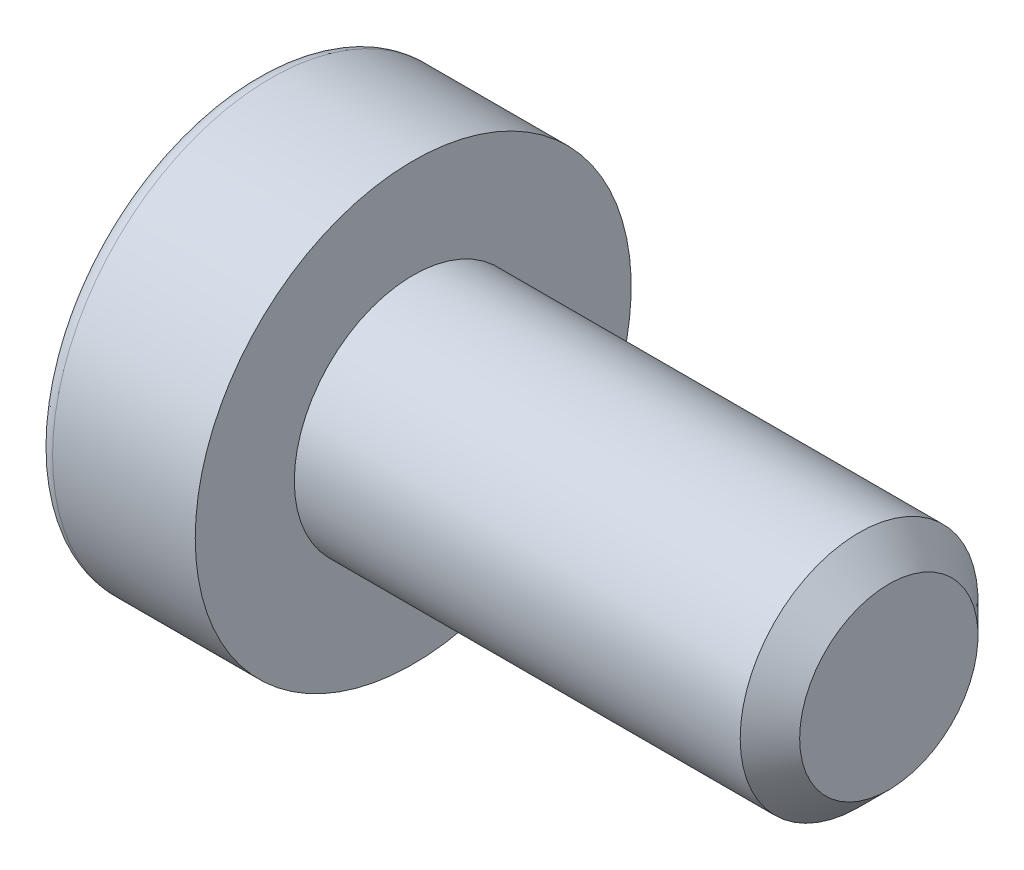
ISO-10303-21;
HEADER;
FILE_DESCRIPTION(('STEP AP214'),'2;1');
FILE_NAME('part.step','',(''),(''),'','','');
FILE_SCHEMA(('AUTOMOTIVE_DESIGN { 1 0 10303 214 1 1 1 1 }'));
ENDSEC;
DATA;
#1=APPLICATION_CONTEXT('core data for automotive mechanical design processes');
#2=APPLICATION_PROTOCOL_DEFINITION('international standard','automotive_design',2000,#1);
#3=PRODUCT_CONTEXT('',#1,'mechanical');
#4=PRODUCT('Part','Part','',(#3));
#5=PRODUCT_RELATED_PRODUCT_CATEGORY('part','',(#4));
#6=PRODUCT_DEFINITION_FORMATION('','',#4);
#7=PRODUCT_DEFINITION_CONTEXT('part definition',#1,'design');
#8=PRODUCT_DEFINITION('design','',#6,#7);
#9=PRODUCT_DEFINITION_SHAPE('','',#8);
#10=(LENGTH_UNIT() NAMED_UNIT(*) SI_UNIT(.MILLI.,.METRE.));
#11=(NAMED_UNIT(*) PLANE_ANGLE_UNIT() SI_UNIT($,.RADIAN.));
#12=(NAMED_UNIT(*) SI_UNIT($,.STERADIAN.) SOLID_ANGLE_UNIT());
#13=UNCERTAINTY_MEASURE_WITH_UNIT(LENGTH_MEASURE(1.E-05),#10,'distance_accuracy_value','');
#14=(GEOMETRIC_REPRESENTATION_CONTEXT(3) GLOBAL_UNCERTAINTY_ASSIGNED_CONTEXT((#13)) GLOBAL_UNIT_ASSIGNED_CONTEXT((#10,
#11,#12)) REPRESENTATION_CONTEXT('',''));
#15=CARTESIAN_POINT('',(0.,0.,0.));
#16=DIRECTION('',(0.,0.,1.));
#17=DIRECTION('',(1.,0.,0.));
#18=AXIS2_PLACEMENT_3D('',#15,#16,#17);
#19=CARTESIAN_POINT('',(0.,2.75000000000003,0.));
#20=DIRECTION('',(0.999999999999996,0.,0.));
#21=DIRECTION('',(0.,0.,-0.999999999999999));
#22=AXIS2_PLACEMENT_3D('',#19,#20,#21);
#23=PLANE('',#22);
#24=CARTESIAN_POINT('',(0.,0.,0.));
#25=DIRECTION('',(0.999999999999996,0.,0.));
#26=DIRECTION('',(0.,0.,-0.999999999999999));
#27=AXIS2_PLACEMENT_3D('',#24,#25,#26);
#28=CIRCLE('',#27,2.55);
#29=CARTESIAN_POINT('',(0.,0.,-2.55));
#30=VERTEX_POINT('',#29);
#31=EDGE_CURVE('E31',#30,#30,#28,.F.);
#32=ORIENTED_EDGE('',*,*,#31,.T.);
#33=EDGE_LOOP('',(#32));
#34=FACE_BOUND('',#33,.T.);
#35=DIRECTION('',(0.,-0.999999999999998,0.));
#36=VECTOR('',#35,1.);
#37=CARTESIAN_POINT('',(0.,0.721687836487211,-1.2499999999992));
#38=LINE('',#37,#36);
#39=CARTESIAN_POINT('',(0.,0.721687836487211,-1.2499999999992));
#40=VERTEX_POINT('',#39);
#41=CARTESIAN_POINT('',(0.,-0.721687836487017,-1.24999999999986));
#42=VERTEX_POINT('',#41);
#43=EDGE_CURVE('E99',#40,#42,#38,.T.);
#44=ORIENTED_EDGE('',*,*,#43,.F.);
#45=DIRECTION('',(0.,-0.499999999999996,-0.866025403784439));
#46=VECTOR('',#45,1.);
#47=CARTESIAN_POINT('',(0.,1.44337567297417,8.88178419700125E-13));
#48=LINE('',#47,#46);
#49=CARTESIAN_POINT('',(0.,1.44337567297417,8.88178419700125E-13));
#50=VERTEX_POINT('',#49);
#51=EDGE_CURVE('E38',#50,#40,#48,.T.);
#52=ORIENTED_EDGE('',*,*,#51,.F.);
#53=DIRECTION('',(0.,0.499999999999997,-0.86602540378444));
#54=VECTOR('',#53,1.);
#55=CARTESIAN_POINT('',(0.,1.44337567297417,8.88178419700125E-13));
#56=LINE('',#55,#54);
#57=CARTESIAN_POINT('',(0.,0.721687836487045,1.25000000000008));
#58=VERTEX_POINT('',#57);
#59=EDGE_CURVE('E129',#58,#50,#56,.T.);
#60=ORIENTED_EDGE('',*,*,#59,.F.);
#61=DIRECTION('',(0.,0.999999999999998,0.));
#62=VECTOR('',#61,1.);
#63=CARTESIAN_POINT('',(0.,0.721687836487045,1.25000000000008));
#64=LINE('',#63,#62);
#65=CARTESIAN_POINT('',(0.,-0.721687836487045,1.24999999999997));
#66=VERTEX_POINT('',#65);
#67=EDGE_CURVE('E124',#66,#58,#64,.T.);
#68=ORIENTED_EDGE('',*,*,#67,.F.);
#69=DIRECTION('',(0.,0.499999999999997,0.866025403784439));
#70=VECTOR('',#69,1.);
#71=CARTESIAN_POINT('',(0.,-0.721687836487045,1.24999999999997));
#72=LINE('',#71,#70);
#73=CARTESIAN_POINT('',(0.,-1.44337567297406,0.));
#74=VERTEX_POINT('',#73);
#75=EDGE_CURVE('E122',#74,#66,#72,.T.);
#76=ORIENTED_EDGE('',*,*,#75,.F.);
#77=DIRECTION('',(0.,-0.499999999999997,0.866025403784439));
#78=VECTOR('',#77,1.);
#79=CARTESIAN_POINT('',(0.,-0.721687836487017,-1.24999999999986));
#80=LINE('',#79,#78);
#81=EDGE_CURVE('E109',#42,#74,#80,.T.);
#82=ORIENTED_EDGE('',*,*,#81,.F.);
#83=EDGE_LOOP('',(#44,#52,#60,#68,#76,#82));
#84=FACE_BOUND('',#83,.T.);
#85=ADVANCED_FACE('F24',(#34,#84),#23,.F.);
#86=CARTESIAN_POINT('',(0.,0.,0.));
#87=DIRECTION('',(-0.999999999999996,0.,0.));
#88=DIRECTION('',(0.,0.,0.999999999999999));
#89=AXIS2_PLACEMENT_3D('',#86,#87,#88);
#90=CYLINDRICAL_SURFACE('',#89,2.75);
#91=CARTESIAN_POINT('',(0.199999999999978,0.,0.));
#92=DIRECTION('',(0.999999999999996,0.,0.));
#93=DIRECTION('',(0.,0.,-0.999999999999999));
#94=AXIS2_PLACEMENT_3D('',#91,#92,#93);
#95=CIRCLE('',#94,2.75);
#96=CARTESIAN_POINT('',(0.199999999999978,0.,2.75));
#97=VERTEX_POINT('',#96);
#98=EDGE_CURVE('E11',#97,#97,#95,.T.);
#99=CARTESIAN_POINT('',(2.,0.,0.));
#100=DIRECTION('',(-0.999999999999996,0.,0.));
#101=DIRECTION('',(0.,0.,0.999999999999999));
#102=AXIS2_PLACEMENT_3D('',#99,#100,#101);
#103=CIRCLE('',#102,2.75);
#104=CARTESIAN_POINT('',(2.,0.,2.75));
#105=VERTEX_POINT('',#104);
#106=EDGE_CURVE('E169',#105,#105,#103,.T.);
#107=CARTESIAN_POINT('',(0.199999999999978,0.,2.75));
#108=CARTESIAN_POINT('',(0.218749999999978,0.,2.75));
#109=CARTESIAN_POINT('',(0.237499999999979,0.,2.75));
#110=CARTESIAN_POINT('',(0.274999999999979,0.,2.75));
#111=CARTESIAN_POINT('',(0.293749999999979,0.,2.75));
#112=CARTESIAN_POINT('',(0.33124999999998,0.,2.75));
#113=CARTESIAN_POINT('',(0.34999999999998,0.,2.75));
#114=CARTESIAN_POINT('',(0.387499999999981,0.,2.75));
#115=CARTESIAN_POINT('',(0.406249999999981,0.,2.75));
#116=CARTESIAN_POINT('',(0.443749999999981,0.,2.75));
#117=CARTESIAN_POINT('',(0.462499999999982,0.,2.75));
#118=CARTESIAN_POINT('',(0.499999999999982,0.,2.75));
#119=CARTESIAN_POINT('',(0.518749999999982,0.,2.75));
#120=CARTESIAN_POINT('',(0.556249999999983,0.,2.75));
#121=CARTESIAN_POINT('',(0.574999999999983,0.,2.75));
#122=CARTESIAN_POINT('',(0.612499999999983,0.,2.75));
#123=CARTESIAN_POINT('',(0.631249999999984,0.,2.75));
#124=CARTESIAN_POINT('',(0.668749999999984,0.,2.75));
#125=CARTESIAN_POINT('',(0.687499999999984,0.,2.75));
#126=CARTESIAN_POINT('',(0.724999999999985,0.,2.75));
#127=CARTESIAN_POINT('',(0.743749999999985,0.,2.75));
#128=CARTESIAN_POINT('',(0.781249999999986,0.,2.75));
#129=CARTESIAN_POINT('',(0.799999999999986,0.,2.75));
#130=CARTESIAN_POINT('',(0.837499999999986,0.,2.75));
#131=CARTESIAN_POINT('',(0.856249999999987,0.,2.75));
#132=CARTESIAN_POINT('',(0.893749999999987,0.,2.75));
#133=CARTESIAN_POINT('',(0.912499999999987,0.,2.75));
#134=CARTESIAN_POINT('',(0.949999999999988,0.,2.75));
#135=CARTESIAN_POINT('',(0.968749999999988,0.,2.75));
#136=CARTESIAN_POINT('',(1.00624999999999,0.,2.75));
#137=CARTESIAN_POINT('',(1.02499999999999,0.,2.75));
#138=CARTESIAN_POINT('',(1.06249999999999,0.,2.75));
#139=CARTESIAN_POINT('',(1.08124999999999,0.,2.75));
#140=CARTESIAN_POINT('',(1.11874999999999,0.,2.75));
#141=CARTESIAN_POINT('',(1.13749999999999,0.,2.75));
#142=CARTESIAN_POINT('',(1.17499999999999,0.,2.75));
#143=CARTESIAN_POINT('',(1.19374999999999,0.,2.75));
#144=CARTESIAN_POINT('',(1.23124999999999,0.,2.75));
#145=CARTESIAN_POINT('',(1.24999999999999,0.,2.75));
#146=CARTESIAN_POINT('',(1.28749999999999,0.,2.75));
#147=CARTESIAN_POINT('',(1.30624999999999,0.,2.75));
#148=CARTESIAN_POINT('',(1.34374999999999,0.,2.75));
#149=CARTESIAN_POINT('',(1.36249999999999,0.,2.75));
#150=CARTESIAN_POINT('',(1.39999999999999,0.,2.75));
#151=CARTESIAN_POINT('',(1.41874999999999,0.,2.75));
#152=CARTESIAN_POINT('',(1.45624999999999,0.,2.75));
#153=CARTESIAN_POINT('',(1.47499999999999,0.,2.75));
#154=CARTESIAN_POINT('',(1.5125,0.,2.75));
#155=CARTESIAN_POINT('',(1.53125,0.,2.75));
#156=CARTESIAN_POINT('',(1.56875,0.,2.75));
#157=CARTESIAN_POINT('',(1.5875,0.,2.75));
#158=CARTESIAN_POINT('',(1.625,0.,2.75));
#159=CARTESIAN_POINT('',(1.64375,0.,2.75));
#160=CARTESIAN_POINT('',(1.68125,0.,2.75));
#161=CARTESIAN_POINT('',(1.7,0.,2.75));
#162=CARTESIAN_POINT('',(1.7375,0.,2.75));
#163=CARTESIAN_POINT('',(1.75625,0.,2.75));
#164=CARTESIAN_POINT('',(1.79375,0.,2.75));
#165=CARTESIAN_POINT('',(1.8125,0.,2.75));
#166=CARTESIAN_POINT('',(1.85,0.,2.75));
#167=CARTESIAN_POINT('',(1.86875,0.,2.75));
#168=CARTESIAN_POINT('',(1.90625,0.,2.75));
#169=CARTESIAN_POINT('',(1.925,0.,2.75));
#170=CARTESIAN_POINT('',(1.9625,0.,2.75));
#171=CARTESIAN_POINT('',(1.98125,0.,2.75));
#172=CARTESIAN_POINT('',(2.,0.,2.75));
#173=B_SPLINE_CURVE_WITH_KNOTS('',3,(#107,#108,#109,#110,#111,#112,#113,#114,#115,#116,#117,
#118,#119,#120,#121,#122,#123,#124,#125,#126,#127,#128,#129,#130,#131,#132,#133,#134,#135,#136,
#137,#138,#139,#140,#141,#142,#143,#144,#145,#146,#147,#148,#149,#150,#151,#152,#153,#154,#155,
#156,#157,#158,#159,#160,#161,#162,#163,#164,#165,#166,#167,#168,#169,#170,#171,#172),
.UNSPECIFIED.,.F.,.F.,(4,2,2,2,2,2,2,2,2,2,2,2,2,2,2,2,2,2,2,2,2,2,2,2,2,2,2,2,2,2,2,2,4),(0.,
0.0562500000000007,0.112500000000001,0.168750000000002,0.225000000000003,0.281250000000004,
0.337500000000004,0.393750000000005,0.450000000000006,0.506250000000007,0.562500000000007,
0.618750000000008,0.675000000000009,0.731250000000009,0.78750000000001,0.843750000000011,
0.900000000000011,0.956250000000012,1.01250000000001,1.06875000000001,1.12500000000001,
1.18125000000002,1.23750000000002,1.29375000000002,1.35000000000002,1.40625000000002,
1.46250000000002,1.51875000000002,1.57500000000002,1.63125000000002,1.68750000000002,
1.74375000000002,1.80000000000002),.UNSPECIFIED.);
#174=EDGE_CURVE('BSEAM196',#97,#105,#173,.T.);
#175=ORIENTED_EDGE('',*,*,#98,.T.);
#176=ORIENTED_EDGE('',*,*,#106,.T.);
#177=ORIENTED_EDGE('',*,*,#174,.T.);
#178=ORIENTED_EDGE('',*,*,#174,.F.);
#179=EDGE_LOOP('',(#175,#177,#176,#178));
#180=FACE_BOUND('',#179,.T.);
#181=ADVANCED_FACE('F196',(#180),#90,.T.);
#182=CARTESIAN_POINT('',(2.,1.49999999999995,0.));
#183=DIRECTION('',(-0.999999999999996,0.,0.));
#184=DIRECTION('',(0.,0.,0.999999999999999));
#185=AXIS2_PLACEMENT_3D('',#182,#183,#184);
#186=PLANE('',#185);
#187=ORIENTED_EDGE('',*,*,#106,.F.);
#188=EDGE_LOOP('',(#187));
#189=FACE_BOUND('',#188,.T.);
#190=CARTESIAN_POINT('',(2.,0.,0.));
#191=DIRECTION('',(-0.999999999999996,0.,0.));
#192=DIRECTION('',(0.,0.,0.999999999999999));
#193=AXIS2_PLACEMENT_3D('',#190,#191,#192);
#194=CIRCLE('',#193,1.5);
#195=CARTESIAN_POINT('',(2.,0.,1.5));
#196=VERTEX_POINT('',#195);
#197=EDGE_CURVE('E165',#196,#196,#194,.T.);
#198=ORIENTED_EDGE('',*,*,#197,.T.);
#199=EDGE_LOOP('',(#198));
#200=FACE_BOUND('',#199,.T.);
#201=ADVANCED_FACE('F201',(#189,#200),#186,.F.);
#202=CARTESIAN_POINT('',(0.,0.,0.));
#203=DIRECTION('',(-0.999999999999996,0.,0.));
#204=DIRECTION('',(0.,0.,0.999999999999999));
#205=AXIS2_PLACEMENT_3D('',#202,#203,#204);
#206=CYLINDRICAL_SURFACE('',#205,1.5);
#207=CARTESIAN_POINT('',(7.62499999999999,0.,0.));
#208=DIRECTION('',(-0.999999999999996,0.,0.));
#209=DIRECTION('',(0.,0.,0.999999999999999));
#210=AXIS2_PLACEMENT_3D('',#207,#208,#209);
#211=CIRCLE('',#210,1.5);
#212=CARTESIAN_POINT('',(7.62499999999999,0.,1.5));
#213=VERTEX_POINT('',#212);
#214=EDGE_CURVE('E172',#213,#213,#211,.T.);
#215=CARTESIAN_POINT('',(7.62499999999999,0.,1.5));
#216=CARTESIAN_POINT('',(7.56640624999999,0.,1.5));
#217=CARTESIAN_POINT('',(7.50781249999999,0.,1.5));
#218=CARTESIAN_POINT('',(7.39062499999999,0.,1.5));
#219=CARTESIAN_POINT('',(7.33203124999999,0.,1.5));
#220=CARTESIAN_POINT('',(7.21484374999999,0.,1.5));
#221=CARTESIAN_POINT('',(7.15624999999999,0.,1.5));
#222=CARTESIAN_POINT('',(7.03906249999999,0.,1.5));
#223=CARTESIAN_POINT('',(6.98046874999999,0.,1.5));
#224=CARTESIAN_POINT('',(6.86328125,0.,1.5));
#225=CARTESIAN_POINT('',(6.80468749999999,0.,1.5));
#226=CARTESIAN_POINT('',(6.6875,0.,1.5));
#227=CARTESIAN_POINT('',(6.62890624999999,0.,1.5));
#228=CARTESIAN_POINT('',(6.51171875,0.,1.5));
#229=CARTESIAN_POINT('',(6.453125,0.,1.5));
#230=CARTESIAN_POINT('',(6.3359375,0.,1.5));
#231=CARTESIAN_POINT('',(6.27734375,0.,1.5));
#232=CARTESIAN_POINT('',(6.16015625,0.,1.5));
#233=CARTESIAN_POINT('',(6.10156249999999,0.,1.5));
#234=CARTESIAN_POINT('',(5.984375,0.,1.5));
#235=CARTESIAN_POINT('',(5.92578125,0.,1.5));
#236=CARTESIAN_POINT('',(5.80859375,0.,1.5));
#237=CARTESIAN_POINT('',(5.75,0.,1.5));
#238=CARTESIAN_POINT('',(5.6328125,0.,1.5));
#239=CARTESIAN_POINT('',(5.57421875,0.,1.5));
#240=CARTESIAN_POINT('',(5.45703125,0.,1.5));
#241=CARTESIAN_POINT('',(5.3984375,0.,1.5));
#242=CARTESIAN_POINT('',(5.28125,0.,1.5));
#243=CARTESIAN_POINT('',(5.22265625,0.,1.5));
#244=CARTESIAN_POINT('',(5.10546875,0.,1.5));
#245=CARTESIAN_POINT('',(5.046875,0.,1.5));
#246=CARTESIAN_POINT('',(4.9296875,0.,1.5));
#247=CARTESIAN_POINT('',(4.87109375,0.,1.5));
#248=CARTESIAN_POINT('',(4.75390625,0.,1.5));
#249=CARTESIAN_POINT('',(4.6953125,0.,1.5));
#250=CARTESIAN_POINT('',(4.578125,0.,1.5));
#251=CARTESIAN_POINT('',(4.51953125,0.,1.5));
#252=CARTESIAN_POINT('',(4.40234375,0.,1.5));
#253=CARTESIAN_POINT('',(4.34375,0.,1.5));
#254=CARTESIAN_POINT('',(4.2265625,0.,1.5));
#255=CARTESIAN_POINT('',(4.16796875,0.,1.5));
#256=CARTESIAN_POINT('',(4.05078125,0.,1.5));
#257=CARTESIAN_POINT('',(3.9921875,0.,1.5));
#258=CARTESIAN_POINT('',(3.875,0.,1.5));
#259=CARTESIAN_POINT('',(3.81640625,0.,1.5));
#260=CARTESIAN_POINT('',(3.69921875,0.,1.5));
#261=CARTESIAN_POINT('',(3.640625,0.,1.5));
#262=CARTESIAN_POINT('',(3.5234375,0.,1.5));
#263=CARTESIAN_POINT('',(3.46484375,0.,1.5));
#264=CARTESIAN_POINT('',(3.34765625,0.,1.5));
#265=CARTESIAN_POINT('',(3.2890625,0.,1.5));
#266=CARTESIAN_POINT('',(3.171875,0.,1.5));
#267=CARTESIAN_POINT('',(3.11328125,0.,1.5));
#268=CARTESIAN_POINT('',(2.99609375,0.,1.5));
#269=CARTESIAN_POINT('',(2.9375,0.,1.5));
#270=CARTESIAN_POINT('',(2.8203125,0.,1.5));
#271=CARTESIAN_POINT('',(2.76171875,0.,1.5));
#272=CARTESIAN_POINT('',(2.64453125,0.,1.5));
#273=CARTESIAN_POINT('',(2.5859375,0.,1.5));
#274=CARTESIAN_POINT('',(2.46875,0.,1.5));
#275=CARTESIAN_POINT('',(2.41015625,0.,1.5));
#276=CARTESIAN_POINT('',(2.29296875,0.,1.5));
#277=CARTESIAN_POINT('',(2.234375,0.,1.5));
#278=CARTESIAN_POINT('',(2.1171875,0.,1.5));
#279=CARTESIAN_POINT('',(2.05859375,0.,1.5));
#280=CARTESIAN_POINT('',(2.,0.,1.5));
#281=B_SPLINE_CURVE_WITH_KNOTS('',3,(#215,#216,#217,#218,#219,#220,#221,#222,#223,#224,#225,
#226,#227,#228,#229,#230,#231,#232,#233,#234,#235,#236,#237,#238,#239,#240,#241,#242,#243,#244,
#245,#246,#247,#248,#249,#250,#251,#252,#253,#254,#255,#256,#257,#258,#259,#260,#261,#262,#263,
#264,#265,#266,#267,#268,#269,#270,#271,#272,#273,#274,#275,#276,#277,#278,#279,#280),
.UNSPECIFIED.,.F.,.F.,(4,2,2,2,2,2,2,2,2,2,2,2,2,2,2,2,2,2,2,2,2,2,2,2,2,2,2,2,2,2,2,2,4),(0.,
0.17578125,0.3515625,0.527343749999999,0.703124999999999,0.878906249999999,1.0546875,1.23046875,
1.40625,1.58203125,1.7578125,1.93359375,2.109375,2.28515625,2.4609375,2.63671875,2.8125,
2.98828125,3.1640625,3.33984375,3.515625,3.69140625,3.86718749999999,4.04296874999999,
4.21874999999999,4.39453124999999,4.57031249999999,4.74609374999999,4.92187499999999,
5.09765624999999,5.27343749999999,5.44921874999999,5.62499999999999),.UNSPECIFIED.);
#282=EDGE_CURVE('BSEAM206',#213,#196,#281,.T.);
#283=ORIENTED_EDGE('',*,*,#214,.T.);
#284=ORIENTED_EDGE('',*,*,#197,.F.);
#285=ORIENTED_EDGE('',*,*,#282,.T.);
#286=ORIENTED_EDGE('',*,*,#282,.F.);
#287=EDGE_LOOP('',(#283,#285,#284,#286));
#288=FACE_BOUND('',#287,.T.);
#289=ADVANCED_FACE('F206',(#288),#206,.T.);
#290=CARTESIAN_POINT('',(8.00000000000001,0.,0.));
#291=DIRECTION('',(-0.999999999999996,0.,0.));
#292=DIRECTION('',(0.,0.,0.999999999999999));
#293=AXIS2_PLACEMENT_3D('',#290,#291,#292);
#294=PLANE('',#293);
#295=CARTESIAN_POINT('',(8.00000000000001,0.,0.));
#296=DIRECTION('',(-0.999999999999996,0.,0.));
#297=DIRECTION('',(0.,0.,0.999999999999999));
#298=AXIS2_PLACEMENT_3D('',#295,#296,#297);
#299=CIRCLE('',#298,1.125);
#300=CARTESIAN_POINT('',(8.00000000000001,0.,1.12499999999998));
#301=VERTEX_POINT('',#300);
#302=EDGE_CURVE('E175',#301,#301,#299,.F.);
#303=ORIENTED_EDGE('',*,*,#302,.T.);
#304=EDGE_LOOP('',(#303));
#305=FACE_BOUND('',#304,.T.);
#306=ADVANCED_FACE('F213',(#305),#294,.F.);
#307=CARTESIAN_POINT('',(7.62499999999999,0.,0.));
#308=DIRECTION('',(-0.999999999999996,0.,0.));
#309=DIRECTION('',(0.,0.,0.999999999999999));
#310=AXIS2_PLACEMENT_3D('',#307,#308,#309);
#311=CONICAL_SURFACE('',#310,1.5,0.785398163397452);
#312=CARTESIAN_POINT('',(8.00000000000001,0.,1.12499999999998));
#313=CARTESIAN_POINT('',(7.99609375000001,0.,1.12890624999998));
#314=CARTESIAN_POINT('',(7.99218750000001,0.,1.13281249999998));
#315=CARTESIAN_POINT('',(7.98437500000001,0.,1.14062499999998));
#316=CARTESIAN_POINT('',(7.98046875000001,0.,1.14453124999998));
#317=CARTESIAN_POINT('',(7.97265625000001,0.,1.15234374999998));
#318=CARTESIAN_POINT('',(7.96875000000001,0.,1.15624999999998));
#319=CARTESIAN_POINT('',(7.96093750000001,0.,1.16406249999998));
#320=CARTESIAN_POINT('',(7.95703125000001,0.,1.16796874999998));
#321=CARTESIAN_POINT('',(7.94921875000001,0.,1.17578124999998));
#322=CARTESIAN_POINT('',(7.9453125,0.,1.17968749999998));
#323=CARTESIAN_POINT('',(7.93750000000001,0.,1.18749999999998));
#324=CARTESIAN_POINT('',(7.93359375,0.,1.19140624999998));
#325=CARTESIAN_POINT('',(7.92578125,0.,1.19921874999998));
#326=CARTESIAN_POINT('',(7.921875,0.,1.20312499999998));
#327=CARTESIAN_POINT('',(7.9140625,0.,1.21093749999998));
#328=CARTESIAN_POINT('',(7.91015625,0.,1.21484374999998));
#329=CARTESIAN_POINT('',(7.90234375,0.,1.22265624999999));
#330=CARTESIAN_POINT('',(7.8984375,0.,1.22656249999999));
#331=CARTESIAN_POINT('',(7.890625,0.,1.23437499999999));
#332=CARTESIAN_POINT('',(7.88671875,0.,1.23828124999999));
#333=CARTESIAN_POINT('',(7.87890625,0.,1.24609374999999));
#334=CARTESIAN_POINT('',(7.875,0.,1.24999999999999));
#335=CARTESIAN_POINT('',(7.8671875,0.,1.25781249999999));
#336=CARTESIAN_POINT('',(7.86328125,0.,1.26171874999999));
#337=CARTESIAN_POINT('',(7.85546875,0.,1.26953124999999));
#338=CARTESIAN_POINT('',(7.8515625,0.,1.27343749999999));
#339=CARTESIAN_POINT('',(7.84375,0.,1.28124999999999));
#340=CARTESIAN_POINT('',(7.83984375,0.,1.28515624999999));
#341=CARTESIAN_POINT('',(7.83203125,0.,1.29296874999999));
#342=CARTESIAN_POINT('',(7.828125,0.,1.29687499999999));
#343=CARTESIAN_POINT('',(7.8203125,0.,1.30468749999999));
#344=CARTESIAN_POINT('',(7.81640625,0.,1.30859374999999));
#345=CARTESIAN_POINT('',(7.80859375,0.,1.31640624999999));
#346=CARTESIAN_POINT('',(7.8046875,0.,1.32031249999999));
#347=CARTESIAN_POINT('',(7.796875,0.,1.32812499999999));
#348=CARTESIAN_POINT('',(7.79296875,0.,1.33203124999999));
#349=CARTESIAN_POINT('',(7.78515625,0.,1.33984374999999));
#350=CARTESIAN_POINT('',(7.78125,0.,1.34374999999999));
#351=CARTESIAN_POINT('',(7.7734375,0.,1.35156249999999));
#352=CARTESIAN_POINT('',(7.76953125,0.,1.35546874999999));
#353=CARTESIAN_POINT('',(7.76171875,0.,1.36328124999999));
#354=CARTESIAN_POINT('',(7.7578125,0.,1.36718749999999));
#355=CARTESIAN_POINT('',(7.75,0.,1.37499999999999));
#356=CARTESIAN_POINT('',(7.74609375,0.,1.37890624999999));
#357=CARTESIAN_POINT('',(7.73828125,0.,1.38671874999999));
#358=CARTESIAN_POINT('',(7.734375,0.,1.39062499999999));
#359=CARTESIAN_POINT('',(7.7265625,0.,1.39843749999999));
#360=CARTESIAN_POINT('',(7.72265625,0.,1.40234374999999));
#361=CARTESIAN_POINT('',(7.71484375,0.,1.41015624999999));
#362=CARTESIAN_POINT('',(7.7109375,0.,1.41406249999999));
#363=CARTESIAN_POINT('',(7.703125,0.,1.42187499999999));
#364=CARTESIAN_POINT('',(7.69921875,0.,1.42578124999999));
#365=CARTESIAN_POINT('',(7.69140625,0.,1.43359375));
#366=CARTESIAN_POINT('',(7.6875,0.,1.4375));
#367=CARTESIAN_POINT('',(7.6796875,0.,1.4453125));
#368=CARTESIAN_POINT('',(7.67578125,0.,1.44921875));
#369=CARTESIAN_POINT('',(7.66796874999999,0.,1.45703125));
#370=CARTESIAN_POINT('',(7.6640625,0.,1.4609375));
#371=CARTESIAN_POINT('',(7.65624999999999,0.,1.46875));
#372=CARTESIAN_POINT('',(7.65234374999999,0.,1.47265625));
#373=CARTESIAN_POINT('',(7.64453124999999,0.,1.48046875));
#374=CARTESIAN_POINT('',(7.64062499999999,0.,1.484375));
#375=CARTESIAN_POINT('',(7.63281249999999,0.,1.4921875));
#376=CARTESIAN_POINT('',(7.62890624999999,0.,1.49609375));
#377=CARTESIAN_POINT('',(7.62499999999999,0.,1.5));
#378=B_SPLINE_CURVE_WITH_KNOTS('',3,(#312,#313,#314,#315,#316,#317,#318,#319,#320,#321,#322,
#323,#324,#325,#326,#327,#328,#329,#330,#331,#332,#333,#334,#335,#336,#337,#338,#339,#340,#341,
#342,#343,#344,#345,#346,#347,#348,#349,#350,#351,#352,#353,#354,#355,#356,#357,#358,#359,#360,
#361,#362,#363,#364,#365,#366,#367,#368,#369,#370,#371,#372,#373,#374,#375,#376,#377),
.UNSPECIFIED.,.F.,.F.,(4,2,2,2,2,2,2,2,2,2,2,2,2,2,2,2,2,2,2,2,2,2,2,2,2,2,2,2,2,2,2,2,4),(0.,
0.0165728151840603,0.0331456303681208,0.0497184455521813,0.0662912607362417,0.0828640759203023,
0.0994368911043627,0.116009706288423,0.132582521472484,0.149155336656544,0.165728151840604,
0.182300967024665,0.198873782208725,0.215446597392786,0.232019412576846,0.248592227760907,
0.265165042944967,0.281737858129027,0.298310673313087,0.314883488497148,0.331456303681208,
0.348029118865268,0.364601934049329,0.38117474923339,0.39774756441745,0.41432037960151,
0.430893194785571,0.447466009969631,0.464038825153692,0.480611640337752,0.497184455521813,
0.513757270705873,0.530330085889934),.UNSPECIFIED.);
#379=EDGE_CURVE('BSEAM217',#301,#213,#378,.T.);
#380=ORIENTED_EDGE('',*,*,#302,.F.);
#381=ORIENTED_EDGE('',*,*,#214,.F.);
#382=ORIENTED_EDGE('',*,*,#379,.T.);
#383=ORIENTED_EDGE('',*,*,#379,.F.);
#384=EDGE_LOOP('',(#380,#382,#381,#383));
#385=FACE_BOUND('',#384,.T.);
#386=ADVANCED_FACE('F217',(#385),#311,.T.);
#387=CARTESIAN_POINT('',(1.,1.44337567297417,8.88178419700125E-13));
#388=DIRECTION('',(0.,0.866025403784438,-0.499999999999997));
#389=DIRECTION('',(0.,0.499999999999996,0.866025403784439));
#390=AXIS2_PLACEMENT_3D('',#387,#388,#389);
#391=PLANE('',#390);
#392=DIRECTION('',(0.,-0.499999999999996,-0.866025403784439));
#393=VECTOR('',#392,1.);
#394=CARTESIAN_POINT('',(1.,1.44337567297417,8.88178419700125E-13));
#395=LINE('',#394,#393);
#396=CARTESIAN_POINT('',(1.,1.44337567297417,8.88178419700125E-13));
#397=VERTEX_POINT('',#396);
#398=CARTESIAN_POINT('',(1.,1.08253175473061,-0.624999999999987));
#399=VERTEX_POINT('',#398);
#400=EDGE_CURVE('E132',#397,#399,#395,.T.);
#401=ORIENTED_EDGE('',*,*,#400,.F.);
#402=DIRECTION('',(-0.999999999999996,0.,0.));
#403=VECTOR('',#402,1.);
#404=CARTESIAN_POINT('',(1.,1.44337567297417,8.88178419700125E-13));
#405=LINE('',#404,#403);
#406=EDGE_CURVE('E151',#397,#50,#405,.T.);
#407=ORIENTED_EDGE('',*,*,#406,.T.);
#408=ORIENTED_EDGE('',*,*,#51,.T.);
#409=DIRECTION('',(-0.999999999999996,0.,0.));
#410=VECTOR('',#409,1.);
#411=CARTESIAN_POINT('',(1.,0.721687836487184,-1.24999999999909));
#412=LINE('',#411,#410);
#413=CARTESIAN_POINT('',(1.,0.721687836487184,-1.24999999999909));
#414=VERTEX_POINT('',#413);
#415=EDGE_CURVE('E106',#414,#40,#412,.T.);
#416=ORIENTED_EDGE('',*,*,#415,.F.);
#417=EDGE_CURVE('E131',#399,#414,#395,.T.);
#418=ORIENTED_EDGE('',*,*,#417,.F.);
#419=EDGE_LOOP('',(#401,#407,#408,#416,#418));
#420=FACE_BOUND('',#419,.T.);
#421=ADVANCED_FACE('F219',(#420),#391,.F.);
#422=CARTESIAN_POINT('',(1.,1.44337567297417,8.88178419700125E-13));
#423=DIRECTION('',(0.,0.866025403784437,0.499999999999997));
#424=DIRECTION('',(0.,-0.499999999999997,0.866025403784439));
#425=AXIS2_PLACEMENT_3D('',#422,#423,#424);
#426=PLANE('',#425);
#427=DIRECTION('',(0.,0.499999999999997,-0.86602540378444));
#428=VECTOR('',#427,1.);
#429=CARTESIAN_POINT('',(1.,1.44337567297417,8.88178419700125E-13));
#430=LINE('',#429,#428);
#431=CARTESIAN_POINT('',(1.,0.721687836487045,1.25000000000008));
#432=VERTEX_POINT('',#431);
#433=CARTESIAN_POINT('',(1.,1.08253175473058,0.624999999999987));
#434=VERTEX_POINT('',#433);
#435=EDGE_CURVE('E148',#432,#434,#430,.T.);
#436=ORIENTED_EDGE('',*,*,#435,.F.);
#437=DIRECTION('',(-0.999999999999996,0.,0.));
#438=VECTOR('',#437,1.);
#439=CARTESIAN_POINT('',(1.,0.721687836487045,1.25000000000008));
#440=LINE('',#439,#438);
#441=EDGE_CURVE('E154',#432,#58,#440,.T.);
#442=ORIENTED_EDGE('',*,*,#441,.T.);
#443=ORIENTED_EDGE('',*,*,#59,.T.);
#444=ORIENTED_EDGE('',*,*,#406,.F.);
#445=EDGE_CURVE('E147',#434,#397,#430,.T.);
#446=ORIENTED_EDGE('',*,*,#445,.F.);
#447=EDGE_LOOP('',(#436,#442,#443,#444,#446));
#448=FACE_BOUND('',#447,.T.);
#449=ADVANCED_FACE('F224',(#448),#426,.F.);
#450=CARTESIAN_POINT('',(1.,0.721687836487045,1.25000000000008));
#451=DIRECTION('',(0.,0.,0.999999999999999));
#452=DIRECTION('',(0.999999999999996,0.,0.));
#453=AXIS2_PLACEMENT_3D('',#450,#451,#452);
#454=PLANE('',#453);
#455=DIRECTION('',(0.,0.999999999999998,0.));
#456=VECTOR('',#455,1.);
#457=CARTESIAN_POINT('',(1.,0.721687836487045,1.25000000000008));
#458=LINE('',#457,#456);
#459=CARTESIAN_POINT('',(1.,-0.721687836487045,1.24999999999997));
#460=VERTEX_POINT('',#459);
#461=CARTESIAN_POINT('',(1.,0.,1.24999999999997));
#462=VERTEX_POINT('',#461);
#463=EDGE_CURVE('E46',#460,#462,#458,.T.);
#464=ORIENTED_EDGE('',*,*,#463,.F.);
#465=DIRECTION('',(-0.999999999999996,0.,0.));
#466=VECTOR('',#465,1.);
#467=CARTESIAN_POINT('',(1.,-0.721687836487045,1.24999999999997));
#468=LINE('',#467,#466);
#469=EDGE_CURVE('E157',#460,#66,#468,.T.);
#470=ORIENTED_EDGE('',*,*,#469,.T.);
#471=ORIENTED_EDGE('',*,*,#67,.T.);
#472=ORIENTED_EDGE('',*,*,#441,.F.);
#473=EDGE_CURVE('E145',#462,#432,#458,.T.);
#474=ORIENTED_EDGE('',*,*,#473,.F.);
#475=EDGE_LOOP('',(#464,#470,#471,#472,#474));
#476=FACE_BOUND('',#475,.T.);
#477=ADVANCED_FACE('F233',(#476),#454,.F.);
#478=CARTESIAN_POINT('',(1.,-0.721687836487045,1.24999999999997));
#479=DIRECTION('',(0.,-0.866025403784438,0.499999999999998));
#480=DIRECTION('',(0.,-0.499999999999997,-0.866025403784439));
#481=AXIS2_PLACEMENT_3D('',#478,#479,#480);
#482=PLANE('',#481);
#483=DIRECTION('',(0.,0.499999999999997,0.866025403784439));
#484=VECTOR('',#483,1.);
#485=CARTESIAN_POINT('',(1.,-0.721687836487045,1.24999999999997));
#486=LINE('',#485,#484);
#487=CARTESIAN_POINT('',(1.,-1.44337567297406,0.));
#488=VERTEX_POINT('',#487);
#489=CARTESIAN_POINT('',(1.,-1.08253175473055,0.625000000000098));
#490=VERTEX_POINT('',#489);
#491=EDGE_CURVE('E142',#488,#490,#486,.T.);
#492=ORIENTED_EDGE('',*,*,#491,.F.);
#493=DIRECTION('',(-0.999999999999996,0.,0.));
#494=VECTOR('',#493,1.);
#495=CARTESIAN_POINT('',(1.,-1.44337567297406,0.));
#496=LINE('',#495,#494);
#497=EDGE_CURVE('E118',#488,#74,#496,.T.);
#498=ORIENTED_EDGE('',*,*,#497,.T.);
#499=ORIENTED_EDGE('',*,*,#75,.T.);
#500=ORIENTED_EDGE('',*,*,#469,.F.);
#501=EDGE_CURVE('E141',#490,#460,#486,.T.);
#502=ORIENTED_EDGE('',*,*,#501,.F.);
#503=EDGE_LOOP('',(#492,#498,#499,#500,#502));
#504=FACE_BOUND('',#503,.T.);
#505=ADVANCED_FACE('F230',(#504),#482,.F.);
#506=CARTESIAN_POINT('',(1.,-0.721687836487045,-1.24999999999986));
#507=DIRECTION('',(0.,-0.866025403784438,-0.499999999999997));
#508=DIRECTION('',(0.,0.499999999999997,-0.866025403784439));
#509=AXIS2_PLACEMENT_3D('',#506,#507,#508);
#510=PLANE('',#509);
#511=DIRECTION('',(0.,-0.499999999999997,0.866025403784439));
#512=VECTOR('',#511,1.);
#513=CARTESIAN_POINT('',(1.,-0.721687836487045,-1.24999999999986));
#514=LINE('',#513,#512);
#515=CARTESIAN_POINT('',(1.,-0.721687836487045,-1.24999999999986));
#516=VERTEX_POINT('',#515);
#517=CARTESIAN_POINT('',(1.,-1.08253175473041,-0.624999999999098));
#518=VERTEX_POINT('',#517);
#519=EDGE_CURVE('E117',#516,#518,#514,.T.);
#520=ORIENTED_EDGE('',*,*,#519,.F.);
#521=DIRECTION('',(-0.999999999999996,0.,0.));
#522=VECTOR('',#521,1.);
#523=CARTESIAN_POINT('',(1.,-0.721687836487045,-1.24999999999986));
#524=LINE('',#523,#522);
#525=EDGE_CURVE('E104',#516,#42,#524,.T.);
#526=ORIENTED_EDGE('',*,*,#525,.T.);
#527=ORIENTED_EDGE('',*,*,#81,.T.);
#528=ORIENTED_EDGE('',*,*,#497,.F.);
#529=EDGE_CURVE('E139',#518,#488,#514,.T.);
#530=ORIENTED_EDGE('',*,*,#529,.F.);
#531=EDGE_LOOP('',(#520,#526,#527,#528,#530));
#532=FACE_BOUND('',#531,.T.);
#533=ADVANCED_FACE('F112',(#532),#510,.F.);
#534=CARTESIAN_POINT('',(1.,0.721687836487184,-1.24999999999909));
#535=DIRECTION('',(0.,0.,-0.999999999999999));
#536=DIRECTION('',(-0.999999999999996,0.,0.));
#537=AXIS2_PLACEMENT_3D('',#534,#535,#536);
#538=PLANE('',#537);
#539=DIRECTION('',(0.,-0.999999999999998,0.));
#540=VECTOR('',#539,1.);
#541=CARTESIAN_POINT('',(1.,0.721687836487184,-1.24999999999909));
#542=LINE('',#541,#540);
#543=CARTESIAN_POINT('',(1.,1.66533453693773E-13,-1.24999999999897));
#544=VERTEX_POINT('',#543);
#545=EDGE_CURVE('E136',#414,#544,#542,.T.);
#546=ORIENTED_EDGE('',*,*,#545,.F.);
#547=ORIENTED_EDGE('',*,*,#415,.T.);
#548=ORIENTED_EDGE('',*,*,#43,.T.);
#549=ORIENTED_EDGE('',*,*,#525,.F.);
#550=EDGE_CURVE('E135',#544,#516,#542,.T.);
#551=ORIENTED_EDGE('',*,*,#550,.F.);
#552=EDGE_LOOP('',(#546,#547,#548,#549,#551));
#553=FACE_BOUND('',#552,.T.);
#554=ADVANCED_FACE('F102',(#553),#538,.F.);
#555=CARTESIAN_POINT('',(1.,0.721687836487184,-1.24999999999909));
#556=DIRECTION('',(-0.999999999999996,0.,0.));
#557=DIRECTION('',(0.,0.,0.999999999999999));
#558=AXIS2_PLACEMENT_3D('',#555,#556,#557);
#559=PLANE('',#558);
#560=ORIENTED_EDGE('',*,*,#473,.T.);
#561=ORIENTED_EDGE('',*,*,#435,.T.);
#562=CARTESIAN_POINT('',(1.,0.,0.));
#563=DIRECTION('',(-0.999999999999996,0.,0.));
#564=DIRECTION('',(0.,0.,0.999999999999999));
#565=AXIS2_PLACEMENT_3D('',#562,#563,#564);
#566=CIRCLE('',#565,1.25);
#567=EDGE_CURVE('E162',#462,#434,#566,.T.);
#568=ORIENTED_EDGE('',*,*,#567,.F.);
#569=EDGE_LOOP('',(#560,#561,#568));
#570=FACE_BOUND('',#569,.T.);
#571=ADVANCED_FACE('F227',(#570),#559,.T.);
#572=ORIENTED_EDGE('',*,*,#445,.T.);
#573=ORIENTED_EDGE('',*,*,#400,.T.);
#574=EDGE_CURVE('E166',#434,#399,#566,.T.);
#575=ORIENTED_EDGE('',*,*,#574,.F.);
#576=EDGE_LOOP('',(#572,#573,#575));
#577=FACE_BOUND('',#576,.T.);
#578=ADVANCED_FACE('F247',(#577),#559,.T.);
#579=ORIENTED_EDGE('',*,*,#417,.T.);
#580=ORIENTED_EDGE('',*,*,#545,.T.);
#581=EDGE_CURVE('E264',#399,#544,#566,.T.);
#582=ORIENTED_EDGE('',*,*,#581,.F.);
#583=EDGE_LOOP('',(#579,#580,#582));
#584=FACE_BOUND('',#583,.T.);
#585=ADVANCED_FACE('F252',(#584),#559,.T.);
#586=ORIENTED_EDGE('',*,*,#550,.T.);
#587=ORIENTED_EDGE('',*,*,#519,.T.);
#588=EDGE_CURVE('E265',#544,#518,#566,.T.);
#589=ORIENTED_EDGE('',*,*,#588,.F.);
#590=EDGE_LOOP('',(#586,#587,#589));
#591=FACE_BOUND('',#590,.T.);
#592=ADVANCED_FACE('F244',(#591),#559,.T.);
#593=ORIENTED_EDGE('',*,*,#529,.T.);
#594=ORIENTED_EDGE('',*,*,#491,.T.);
#595=EDGE_CURVE('E267',#518,#490,#566,.T.);
#596=ORIENTED_EDGE('',*,*,#595,.F.);
#597=EDGE_LOOP('',(#593,#594,#596));
#598=FACE_BOUND('',#597,.T.);
#599=ADVANCED_FACE('F240',(#598),#559,.T.);
#600=ORIENTED_EDGE('',*,*,#501,.T.);
#601=ORIENTED_EDGE('',*,*,#463,.T.);
#602=EDGE_CURVE('E153',#490,#462,#566,.T.);
#603=ORIENTED_EDGE('',*,*,#602,.F.);
#604=EDGE_LOOP('',(#600,#601,#603));
#605=FACE_BOUND('',#604,.T.);
#606=ADVANCED_FACE('F190',(#605),#559,.T.);
#607=CARTESIAN_POINT('',(1.80000000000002,0.,0.));
#608=DIRECTION('',(-0.999999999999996,0.,0.));
#609=DIRECTION('',(0.,0.,0.999999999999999));
#610=AXIS2_PLACEMENT_3D('',#607,#608,#609);
#611=CONICAL_SURFACE('',#610,0.,1.00148313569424);
#612=ORIENTED_EDGE('',*,*,#567,.T.);
#613=ORIENTED_EDGE('',*,*,#574,.T.);
#614=ORIENTED_EDGE('',*,*,#581,.T.);
#615=ORIENTED_EDGE('',*,*,#588,.T.);
#616=ORIENTED_EDGE('',*,*,#595,.T.);
#617=ORIENTED_EDGE('',*,*,#602,.T.);
#618=EDGE_LOOP('',(#612,#613,#614,#615,#616,#617));
#619=FACE_BOUND('',#618,.T.);
#620=CARTESIAN_POINT('',(1.80000000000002,0.,0.));
#621=VERTEX_POINT('',#620);
#622=VERTEX_LOOP('',#621);
#623=FACE_BOUND('',#622,.T.);
#624=ADVANCED_FACE('F183',(#619,#623),#611,.F.);
#625=CARTESIAN_POINT('',(0.199999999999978,0.,0.));
#626=DIRECTION('',(0.999999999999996,0.,0.));
#627=DIRECTION('',(0.,0.,-0.999999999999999));
#628=AXIS2_PLACEMENT_3D('',#625,#626,#627);
#629=TOROIDAL_SURFACE('',#628,2.55,0.2);
#630=ORIENTED_EDGE('',*,*,#98,.F.);
#631=EDGE_LOOP('',(#630));
#632=FACE_BOUND('',#631,.T.);
#633=ORIENTED_EDGE('',*,*,#31,.F.);
#634=EDGE_LOOP('',(#633));
#635=FACE_BOUND('',#634,.T.);
#636=ADVANCED_FACE('F181',(#632,#635),#629,.T.);
#637=CLOSED_SHELL('',(#85,#181,#201,#289,#306,#386,#421,#449,#477,#505,#533,#554,#571,#578,#585,
#592,#599,#606,#624,#636));
#638=MANIFOLD_SOLID_BREP('B2',#637);
#639=ADVANCED_BREP_SHAPE_REPRESENTATION('',(#18,#638),#14);
#640=SHAPE_DEFINITION_REPRESENTATION(#9,#639);
ENDSEC;
END-ISO-10303-21;
